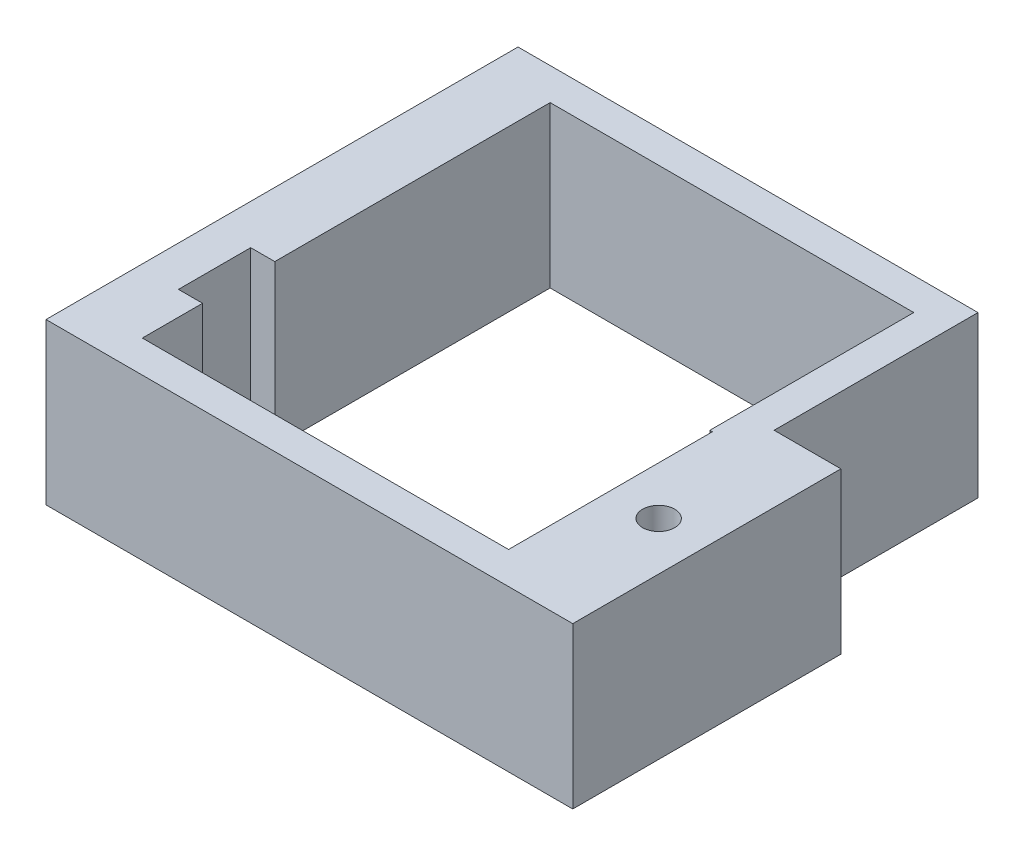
from build123d import *

# Parameters (mm, degrees)
BOSS_EXTRUDE1_DEPTH = 10
CUT_EXTRUDE1_DEPTH  = 46.175835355
SKETCH3_W           = 1.5
SKETCH3_H           = 4.5
CUT_EXTRUDE2_DEPTH  = 46.175835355


with BuildPart() as part:
    # Sketch1 → Boss-Extrude1 (new body)
    with BuildSketch(Plane(origin=(0, 0, 0), x_dir=(1, 0, 0), z_dir=(0, 1, 0))):
        Polygon((0, 0), (0, 29.4), (28.65, 29.4), (28.65, 16.7), (32.81, 16.7), (32.81, 0), align=None)
        Polygon((26.81, 6.739099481), (26.81, 14.7), (26.65, 14.7), (26.65, 27.4), (4, 27.4), (4, 2), (26.81, 2), align=None, mode=Mode.SUBTRACT)
    extrude(amount=BOSS_EXTRUDE1_DEPTH)

    # Sketch2 → Cut-Extrude1 (cut, through all)
    with BuildSketch(Plane(origin=(0, 10, 0), x_dir=(1, 0, 0), z_dir=(0, 1, 0))):
        with BuildLine():
            ThreePointArc((30.237168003, 9.254172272), (29.81, 9.35), (29.382831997, 9.254172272))
            Line((29.382831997, 9.254172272), (29.81, 8.35))
            Line((29.81, 8.35), (30.237168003, 9.254172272))
        make_face()
        with BuildLine():
            Line((29.81, 8.35), (29.382831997, 9.254172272))
            ThreePointArc((29.382831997, 9.254172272), (28.81, 8.35), (29.382831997, 7.445827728))
            Line((29.382831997, 7.445827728), (29.81, 8.35))
        make_face()
        with BuildLine():
            ThreePointArc((30.81, 8.35), (30.654739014, 8.885178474), (30.237168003, 9.254172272))
            Line((30.237168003, 9.254172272), (29.81, 8.35))
            Line((29.81, 8.35), (30.237168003, 7.445827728))
            ThreePointArc((30.237168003, 7.445827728), (30.654739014, 7.814821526), (30.81, 8.35))
        make_face()
        with BuildLine():
            Line((29.81, 8.35), (29.382831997, 7.445827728))
            ThreePointArc((29.382831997, 7.445827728), (29.81, 7.35), (30.237168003, 7.445827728))
            Line((30.237168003, 7.445827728), (29.81, 8.35))
        make_face()
        with BuildLine():
            ThreePointArc((30.237168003, 9.254172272), (29.81, 9.35), (29.382831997, 9.254172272))
            Line((29.382831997, 9.254172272), (29.81, 8.35))
            Line((29.81, 8.35), (30.237168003, 9.254172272))
        make_face()
        with BuildLine():
            Line((29.81, 8.35), (29.382831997, 9.254172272))
            ThreePointArc((29.382831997, 9.254172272), (28.81, 8.35), (29.382831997, 7.445827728))
            Line((29.382831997, 7.445827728), (29.81, 8.35))
        make_face()
        with BuildLine():
            ThreePointArc((30.81, 8.35), (30.654739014, 8.885178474), (30.237168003, 9.254172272))
            Line((30.237168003, 9.254172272), (29.81, 8.35))
            Line((29.81, 8.35), (30.237168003, 7.445827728))
            ThreePointArc((30.237168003, 7.445827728), (30.654739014, 7.814821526), (30.81, 8.35))
        make_face()
        with BuildLine():
            Line((29.81, 8.35), (29.382831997, 7.445827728))
            ThreePointArc((29.382831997, 7.445827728), (29.81, 7.35), (30.237168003, 7.445827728))
            Line((30.237168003, 7.445827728), (29.81, 8.35))
        make_face()
        with BuildLine():
            ThreePointArc((30.237168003, 9.254172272), (29.81, 9.35), (29.382831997, 9.254172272))
            Line((29.382831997, 9.254172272), (29.81, 8.35))
            Line((29.81, 8.35), (30.237168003, 9.254172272))
        make_face()
        with BuildLine():
            Line((29.81, 8.35), (29.382831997, 9.254172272))
            ThreePointArc((29.382831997, 9.254172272), (28.81, 8.35), (29.382831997, 7.445827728))
            Line((29.382831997, 7.445827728), (29.81, 8.35))
        make_face()
        with BuildLine():
            ThreePointArc((30.81, 8.35), (30.654739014, 8.885178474), (30.237168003, 9.254172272))
            Line((30.237168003, 9.254172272), (29.81, 8.35))
            Line((29.81, 8.35), (30.237168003, 7.445827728))
            ThreePointArc((30.237168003, 7.445827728), (30.654739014, 7.814821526), (30.81, 8.35))
        make_face()
        with BuildLine():
            Line((29.81, 8.35), (29.382831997, 7.445827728))
            ThreePointArc((29.382831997, 7.445827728), (29.81, 7.35), (30.237168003, 7.445827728))
            Line((30.237168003, 7.445827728), (29.81, 8.35))
        make_face()
        with BuildLine():
            ThreePointArc((30.237168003, 9.254172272), (29.81, 9.35), (29.382831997, 9.254172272))
            Line((29.382831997, 9.254172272), (29.81, 8.35))
            Line((29.81, 8.35), (30.237168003, 9.254172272))
        make_face()
        with BuildLine():
            Line((29.81, 8.35), (29.382831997, 9.254172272))
            ThreePointArc((29.382831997, 9.254172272), (28.81, 8.35), (29.382831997, 7.445827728))
            Line((29.382831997, 7.445827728), (29.81, 8.35))
        make_face()
        with BuildLine():
            ThreePointArc((30.81, 8.35), (30.654739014, 8.885178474), (30.237168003, 9.254172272))
            Line((30.237168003, 9.254172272), (29.81, 8.35))
            Line((29.81, 8.35), (30.237168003, 7.445827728))
            ThreePointArc((30.237168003, 7.445827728), (30.654739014, 7.814821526), (30.81, 8.35))
        make_face()
        with BuildLine():
            Line((29.81, 8.35), (29.382831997, 7.445827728))
            ThreePointArc((29.382831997, 7.445827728), (29.81, 7.35), (30.237168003, 7.445827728))
            Line((30.237168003, 7.445827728), (29.81, 8.35))
        make_face()
    extrude(amount=-CUT_EXTRUDE1_DEPTH, mode=Mode.SUBTRACT)

    # Sketch3 → Cut-Extrude2 (cut, through all)
    with BuildSketch(Plane(origin=(0, 10, 0), x_dir=(1, 0, 0), z_dir=(0, 1, 0))):
        with Locations((3.25, 8)):
            Rectangle(SKETCH3_W, SKETCH3_H)
        with Locations((-0.75, 8)):
            Rectangle(SKETCH3_W, SKETCH3_H)
    extrude(amount=-CUT_EXTRUDE2_DEPTH, mode=Mode.SUBTRACT)


solid = part.part
